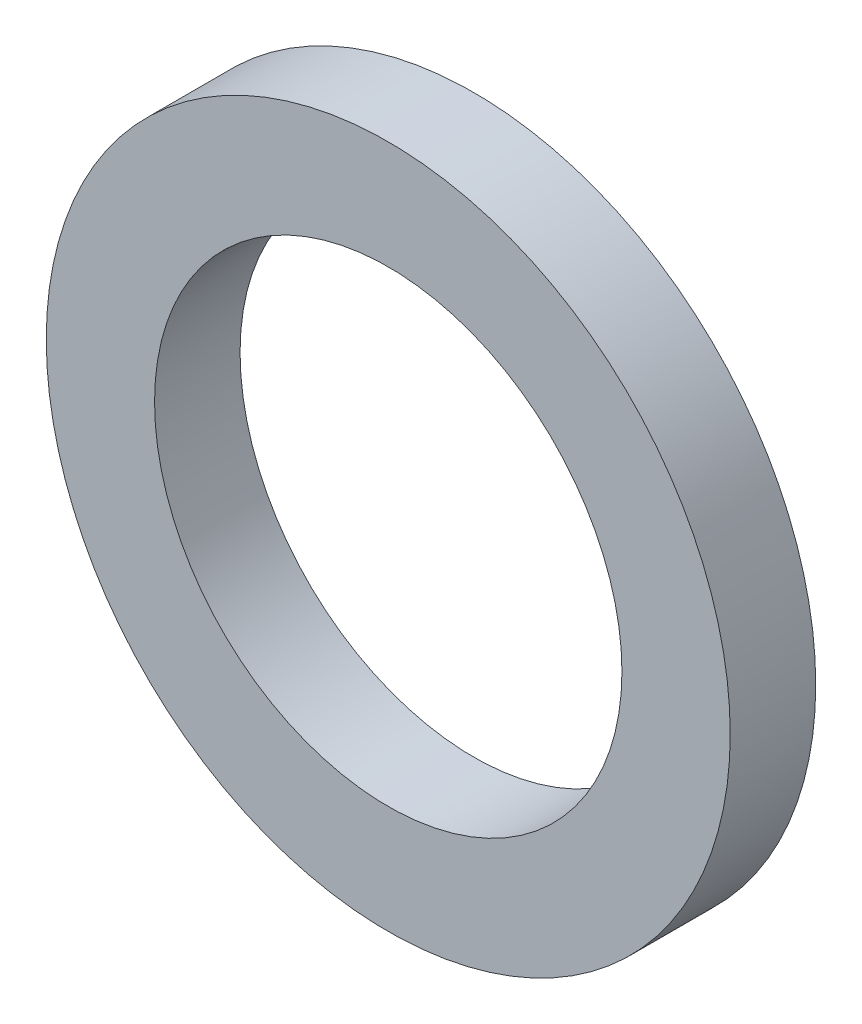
ISO-10303-21;
HEADER;
FILE_DESCRIPTION(('STEP AP214'),'2;1');
FILE_NAME('part.step','',(''),(''),'','','');
FILE_SCHEMA(('AUTOMOTIVE_DESIGN { 1 0 10303 214 1 1 1 1 }'));
ENDSEC;
DATA;
#1=APPLICATION_CONTEXT('core data for automotive mechanical design processes');
#2=APPLICATION_PROTOCOL_DEFINITION('international standard','automotive_design',2000,#1);
#3=PRODUCT_CONTEXT('',#1,'mechanical');
#4=PRODUCT('Part','Part','',(#3));
#5=PRODUCT_RELATED_PRODUCT_CATEGORY('part','',(#4));
#6=PRODUCT_DEFINITION_FORMATION('','',#4);
#7=PRODUCT_DEFINITION_CONTEXT('part definition',#1,'design');
#8=PRODUCT_DEFINITION('design','',#6,#7);
#9=PRODUCT_DEFINITION_SHAPE('','',#8);
#10=(LENGTH_UNIT() NAMED_UNIT(*) SI_UNIT(.MILLI.,.METRE.));
#11=(NAMED_UNIT(*) PLANE_ANGLE_UNIT() SI_UNIT($,.RADIAN.));
#12=(NAMED_UNIT(*) SI_UNIT($,.STERADIAN.) SOLID_ANGLE_UNIT());
#13=UNCERTAINTY_MEASURE_WITH_UNIT(LENGTH_MEASURE(1.E-05),#10,'distance_accuracy_value','');
#14=(GEOMETRIC_REPRESENTATION_CONTEXT(3) GLOBAL_UNCERTAINTY_ASSIGNED_CONTEXT((#13)) GLOBAL_UNIT_ASSIGNED_CONTEXT((#10,
#11,#12)) REPRESENTATION_CONTEXT('',''));
#15=CARTESIAN_POINT('',(0.,0.,0.));
#16=DIRECTION('',(0.,0.,1.));
#17=DIRECTION('',(1.,0.,0.));
#18=AXIS2_PLACEMENT_3D('',#15,#16,#17);
#19=CARTESIAN_POINT('',(0.,6.,-0.75));
#20=DIRECTION('',(0.,0.,-1.));
#21=DIRECTION('',(-1.,0.,0.));
#22=AXIS2_PLACEMENT_3D('',#19,#20,#21);
#23=PLANE('',#22);
#24=CARTESIAN_POINT('',(0.,0.,-0.75));
#25=DIRECTION('',(0.,0.,-1.));
#26=DIRECTION('',(-1.,0.,0.));
#27=AXIS2_PLACEMENT_3D('',#24,#25,#26);
#28=CIRCLE('',#27,6.);
#29=CARTESIAN_POINT('',(-6.,0.,-0.75));
#30=VERTEX_POINT('',#29);
#31=EDGE_CURVE('E10',#30,#30,#28,.T.);
#32=ORIENTED_EDGE('',*,*,#31,.T.);
#33=EDGE_LOOP('',(#32));
#34=FACE_BOUND('',#33,.T.);
#35=CARTESIAN_POINT('',(0.,0.,-0.75));
#36=DIRECTION('',(0.,0.,-1.));
#37=DIRECTION('',(-1.,0.,0.));
#38=AXIS2_PLACEMENT_3D('',#35,#36,#37);
#39=CIRCLE('',#38,4.1);
#40=CARTESIAN_POINT('',(-4.1,0.,-0.75));
#41=VERTEX_POINT('',#40);
#42=EDGE_CURVE('E45',#41,#41,#39,.T.);
#43=ORIENTED_EDGE('',*,*,#42,.F.);
#44=EDGE_LOOP('',(#43));
#45=FACE_BOUND('',#44,.T.);
#46=ADVANCED_FACE('F31',(#34,#45),#23,.T.);
#47=CARTESIAN_POINT('',(0.,0.,0.));
#48=DIRECTION('',(0.,0.,-1.));
#49=DIRECTION('',(-1.,0.,0.));
#50=AXIS2_PLACEMENT_3D('',#47,#48,#49);
#51=CYLINDRICAL_SURFACE('',#50,6.);
#52=CARTESIAN_POINT('',(0.,0.,0.75));
#53=DIRECTION('',(0.,0.,-1.));
#54=DIRECTION('',(-1.,0.,0.));
#55=AXIS2_PLACEMENT_3D('',#52,#53,#54);
#56=CIRCLE('',#55,6.);
#57=CARTESIAN_POINT('',(-6.,0.,0.75));
#58=VERTEX_POINT('',#57);
#59=EDGE_CURVE('E37',#58,#58,#56,.T.);
#60=ORIENTED_EDGE('',*,*,#59,.T.);
#61=EDGE_LOOP('',(#60));
#62=FACE_BOUND('',#61,.T.);
#63=ORIENTED_EDGE('',*,*,#31,.F.);
#64=EDGE_LOOP('',(#63));
#65=FACE_BOUND('',#64,.T.);
#66=ADVANCED_FACE('F55',(#62,#65),#51,.T.);
#67=CARTESIAN_POINT('',(0.,6.,0.75));
#68=DIRECTION('',(0.,0.,1.));
#69=DIRECTION('',(1.,0.,0.));
#70=AXIS2_PLACEMENT_3D('',#67,#68,#69);
#71=PLANE('',#70);
#72=CARTESIAN_POINT('',(0.,0.,0.75));
#73=DIRECTION('',(0.,0.,-1.));
#74=DIRECTION('',(-1.,0.,0.));
#75=AXIS2_PLACEMENT_3D('',#72,#73,#74);
#76=CIRCLE('',#75,4.1);
#77=CARTESIAN_POINT('',(-4.1,0.,0.75));
#78=VERTEX_POINT('',#77);
#79=EDGE_CURVE('E41',#78,#78,#76,.T.);
#80=ORIENTED_EDGE('',*,*,#79,.T.);
#81=EDGE_LOOP('',(#80));
#82=FACE_BOUND('',#81,.T.);
#83=ORIENTED_EDGE('',*,*,#59,.F.);
#84=EDGE_LOOP('',(#83));
#85=FACE_BOUND('',#84,.T.);
#86=ADVANCED_FACE('F59',(#82,#85),#71,.T.);
#87=CARTESIAN_POINT('',(0.,0.,0.));
#88=DIRECTION('',(0.,0.,-1.));
#89=DIRECTION('',(-1.,0.,0.));
#90=AXIS2_PLACEMENT_3D('',#87,#88,#89);
#91=CYLINDRICAL_SURFACE('',#90,4.1);
#92=ORIENTED_EDGE('',*,*,#42,.T.);
#93=EDGE_LOOP('',(#92));
#94=FACE_BOUND('',#93,.T.);
#95=ORIENTED_EDGE('',*,*,#79,.F.);
#96=EDGE_LOOP('',(#95));
#97=FACE_BOUND('',#96,.T.);
#98=ADVANCED_FACE('F51',(#94,#97),#91,.F.);
#99=CLOSED_SHELL('',(#46,#66,#86,#98));
#100=MANIFOLD_SOLID_BREP('B2',#99);
#101=ADVANCED_BREP_SHAPE_REPRESENTATION('',(#18,#100),#14);
#102=SHAPE_DEFINITION_REPRESENTATION(#9,#101);
ENDSEC;
END-ISO-10303-21;
